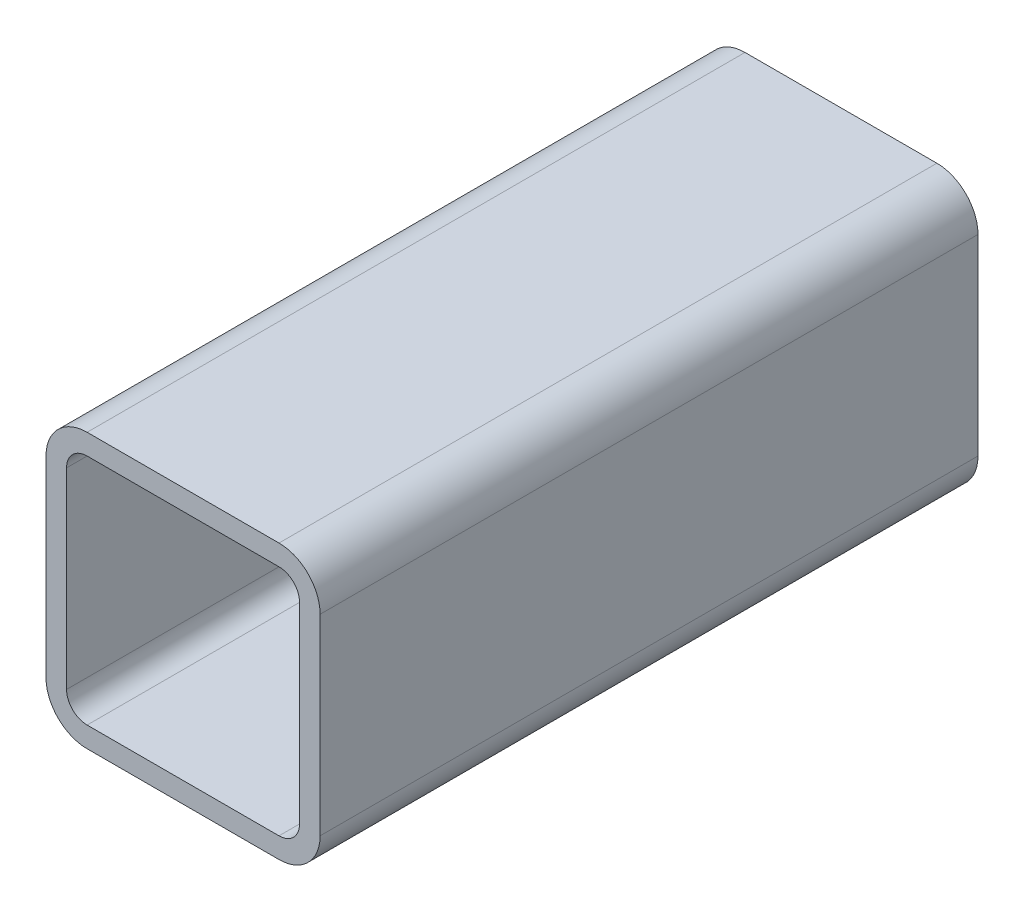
ISO-10303-21;
HEADER;
FILE_DESCRIPTION(('STEP AP214'),'2;1');
FILE_NAME('part.step','',(''),(''),'','','');
FILE_SCHEMA(('AUTOMOTIVE_DESIGN { 1 0 10303 214 1 1 1 1 }'));
ENDSEC;
DATA;
#1=APPLICATION_CONTEXT('core data for automotive mechanical design processes');
#2=APPLICATION_PROTOCOL_DEFINITION('international standard','automotive_design',2000,#1);
#3=PRODUCT_CONTEXT('',#1,'mechanical');
#4=PRODUCT('Part','Part','',(#3));
#5=PRODUCT_RELATED_PRODUCT_CATEGORY('part','',(#4));
#6=PRODUCT_DEFINITION_FORMATION('','',#4);
#7=PRODUCT_DEFINITION_CONTEXT('part definition',#1,'design');
#8=PRODUCT_DEFINITION('design','',#6,#7);
#9=PRODUCT_DEFINITION_SHAPE('','',#8);
#10=(LENGTH_UNIT() NAMED_UNIT(*) SI_UNIT(.MILLI.,.METRE.));
#11=(NAMED_UNIT(*) PLANE_ANGLE_UNIT() SI_UNIT($,.RADIAN.));
#12=(NAMED_UNIT(*) SI_UNIT($,.STERADIAN.) SOLID_ANGLE_UNIT());
#13=UNCERTAINTY_MEASURE_WITH_UNIT(LENGTH_MEASURE(1.E-05),#10,'distance_accuracy_value','');
#14=(GEOMETRIC_REPRESENTATION_CONTEXT(3) GLOBAL_UNCERTAINTY_ASSIGNED_CONTEXT((#13)) GLOBAL_UNIT_ASSIGNED_CONTEXT((#10,
#11,#12)) REPRESENTATION_CONTEXT('',''));
#15=CARTESIAN_POINT('',(0.,0.,0.));
#16=DIRECTION('',(0.,0.,1.));
#17=DIRECTION('',(1.,0.,0.));
#18=AXIS2_PLACEMENT_3D('',#15,#16,#17);
#19=CARTESIAN_POINT('',(19.9112396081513,109.98485662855,304.8));
#20=DIRECTION('',(0.,0.,1.));
#21=DIRECTION('',(1.,0.,0.));
#22=AXIS2_PLACEMENT_3D('',#19,#20,#21);
#23=PLANE('',#22);
#24=CARTESIAN_POINT('',(19.9112396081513,109.98485662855,304.8));
#25=DIRECTION('',(0.,0.,1.));
#26=DIRECTION('',(1.,0.,0.));
#27=AXIS2_PLACEMENT_3D('',#24,#25,#26);
#28=CIRCLE('',#27,19.05);
#29=CARTESIAN_POINT('',(19.9112396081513,129.03485662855,304.8));
#30=VERTEX_POINT('',#29);
#31=CARTESIAN_POINT('',(0.8612396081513,109.98485662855,304.8));
#32=VERTEX_POINT('',#31);
#33=EDGE_CURVE('E211',#30,#32,#28,.T.);
#34=ORIENTED_EDGE('',*,*,#33,.T.);
#35=DIRECTION('',(0.,-1.,0.));
#36=VECTOR('',#35,1.);
#37=CARTESIAN_POINT('',(0.8612396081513,21.0848566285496,304.8));
#38=LINE('',#37,#36);
#39=CARTESIAN_POINT('',(0.8612396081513,21.0848566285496,304.8));
#40=VERTEX_POINT('',#39);
#41=EDGE_CURVE('E214',#32,#40,#38,.T.);
#42=ORIENTED_EDGE('',*,*,#41,.T.);
#43=CARTESIAN_POINT('',(19.9112396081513,21.0848566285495,304.8));
#44=DIRECTION('',(0.,0.,1.));
#45=DIRECTION('',(1.,0.,0.));
#46=AXIS2_PLACEMENT_3D('',#43,#44,#45);
#47=CIRCLE('',#46,19.05);
#48=CARTESIAN_POINT('',(19.9112396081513,2.03485662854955,304.8));
#49=VERTEX_POINT('',#48);
#50=EDGE_CURVE('E217',#40,#49,#47,.T.);
#51=ORIENTED_EDGE('',*,*,#50,.T.);
#52=DIRECTION('',(1.,0.,0.));
#53=VECTOR('',#52,1.);
#54=CARTESIAN_POINT('',(108.811239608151,2.03485662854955,304.8));
#55=LINE('',#54,#53);
#56=CARTESIAN_POINT('',(108.811239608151,2.03485662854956,304.8));
#57=VERTEX_POINT('',#56);
#58=EDGE_CURVE('E219',#49,#57,#55,.T.);
#59=ORIENTED_EDGE('',*,*,#58,.T.);
#60=CARTESIAN_POINT('',(108.811239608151,21.0848566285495,304.8));
#61=DIRECTION('',(0.,0.,1.));
#62=DIRECTION('',(1.,0.,0.));
#63=AXIS2_PLACEMENT_3D('',#60,#61,#62);
#64=CIRCLE('',#63,19.05);
#65=CARTESIAN_POINT('',(127.861239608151,21.0848566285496,304.8));
#66=VERTEX_POINT('',#65);
#67=EDGE_CURVE('E221',#57,#66,#64,.T.);
#68=ORIENTED_EDGE('',*,*,#67,.T.);
#69=DIRECTION('',(0.,1.,0.));
#70=VECTOR('',#69,1.);
#71=CARTESIAN_POINT('',(127.861239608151,109.98485662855,304.8));
#72=LINE('',#71,#70);
#73=CARTESIAN_POINT('',(127.861239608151,109.98485662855,304.8));
#74=VERTEX_POINT('',#73);
#75=EDGE_CURVE('E223',#66,#74,#72,.T.);
#76=ORIENTED_EDGE('',*,*,#75,.T.);
#77=CARTESIAN_POINT('',(108.811239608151,109.98485662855,304.8));
#78=DIRECTION('',(0.,0.,1.));
#79=DIRECTION('',(1.,0.,0.));
#80=AXIS2_PLACEMENT_3D('',#77,#78,#79);
#81=CIRCLE('',#80,19.05);
#82=CARTESIAN_POINT('',(108.811239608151,129.03485662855,304.8));
#83=VERTEX_POINT('',#82);
#84=EDGE_CURVE('E225',#74,#83,#81,.T.);
#85=ORIENTED_EDGE('',*,*,#84,.T.);
#86=DIRECTION('',(-1.,0.,0.));
#87=VECTOR('',#86,1.);
#88=CARTESIAN_POINT('',(19.9112396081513,129.03485662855,304.8));
#89=LINE('',#88,#87);
#90=EDGE_CURVE('E227',#83,#30,#89,.T.);
#91=ORIENTED_EDGE('',*,*,#90,.T.);
#92=EDGE_LOOP('',(#34,#42,#51,#59,#68,#76,#85,#91));
#93=FACE_BOUND('',#92,.T.);
#94=DIRECTION('',(0.,-1.,0.));
#95=VECTOR('',#94,1.);
#96=CARTESIAN_POINT('',(10.3862396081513,21.0848566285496,304.8));
#97=LINE('',#96,#95);
#98=CARTESIAN_POINT('',(10.3862396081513,109.98485662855,304.8));
#99=VERTEX_POINT('',#98);
#100=CARTESIAN_POINT('',(10.3862396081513,21.0848566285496,304.8));
#101=VERTEX_POINT('',#100);
#102=EDGE_CURVE('E154',#99,#101,#97,.T.);
#103=ORIENTED_EDGE('',*,*,#102,.F.);
#104=CARTESIAN_POINT('',(19.9112396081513,109.98485662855,304.8));
#105=DIRECTION('',(0.,0.,1.));
#106=DIRECTION('',(1.,0.,0.));
#107=AXIS2_PLACEMENT_3D('',#104,#105,#106);
#108=CIRCLE('',#107,9.52499999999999);
#109=CARTESIAN_POINT('',(19.9112396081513,119.50985662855,304.8));
#110=VERTEX_POINT('',#109);
#111=EDGE_CURVE('E146',#110,#99,#108,.T.);
#112=ORIENTED_EDGE('',*,*,#111,.F.);
#113=DIRECTION('',(-1.,0.,0.));
#114=VECTOR('',#113,1.);
#115=CARTESIAN_POINT('',(19.9112396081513,119.50985662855,304.8));
#116=LINE('',#115,#114);
#117=CARTESIAN_POINT('',(108.811239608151,119.50985662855,304.8));
#118=VERTEX_POINT('',#117);
#119=EDGE_CURVE('E179',#118,#110,#116,.T.);
#120=ORIENTED_EDGE('',*,*,#119,.F.);
#121=CARTESIAN_POINT('',(108.811239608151,109.98485662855,304.8));
#122=DIRECTION('',(0.,0.,1.));
#123=DIRECTION('',(1.,0.,0.));
#124=AXIS2_PLACEMENT_3D('',#121,#122,#123);
#125=CIRCLE('',#124,9.52500000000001);
#126=CARTESIAN_POINT('',(118.336239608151,109.98485662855,304.8));
#127=VERTEX_POINT('',#126);
#128=EDGE_CURVE('E177',#127,#118,#125,.T.);
#129=ORIENTED_EDGE('',*,*,#128,.F.);
#130=DIRECTION('',(0.,1.,0.));
#131=VECTOR('',#130,1.);
#132=CARTESIAN_POINT('',(118.336239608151,109.98485662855,304.8));
#133=LINE('',#132,#131);
#134=CARTESIAN_POINT('',(118.336239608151,21.0848566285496,304.8));
#135=VERTEX_POINT('',#134);
#136=EDGE_CURVE('E175',#135,#127,#133,.T.);
#137=ORIENTED_EDGE('',*,*,#136,.F.);
#138=CARTESIAN_POINT('',(108.811239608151,21.0848566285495,304.8));
#139=DIRECTION('',(0.,0.,1.));
#140=DIRECTION('',(1.,0.,0.));
#141=AXIS2_PLACEMENT_3D('',#138,#139,#140);
#142=CIRCLE('',#141,9.52499999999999);
#143=CARTESIAN_POINT('',(108.811239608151,11.5598566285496,304.8));
#144=VERTEX_POINT('',#143);
#145=EDGE_CURVE('E173',#144,#135,#142,.T.);
#146=ORIENTED_EDGE('',*,*,#145,.F.);
#147=DIRECTION('',(1.,0.,0.));
#148=VECTOR('',#147,1.);
#149=CARTESIAN_POINT('',(108.811239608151,11.5598566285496,304.8));
#150=LINE('',#149,#148);
#151=CARTESIAN_POINT('',(19.9112396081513,11.5598566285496,304.8));
#152=VERTEX_POINT('',#151);
#153=EDGE_CURVE('E169',#152,#144,#150,.T.);
#154=ORIENTED_EDGE('',*,*,#153,.F.);
#155=CARTESIAN_POINT('',(19.9112396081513,21.0848566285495,304.8));
#156=DIRECTION('',(0.,0.,1.));
#157=DIRECTION('',(1.,0.,0.));
#158=AXIS2_PLACEMENT_3D('',#155,#156,#157);
#159=CIRCLE('',#158,9.52499999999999);
#160=EDGE_CURVE('E167',#101,#152,#159,.T.);
#161=ORIENTED_EDGE('',*,*,#160,.F.);
#162=EDGE_LOOP('',(#103,#112,#120,#129,#137,#146,#154,#161));
#163=FACE_BOUND('',#162,.T.);
#164=ADVANCED_FACE('F33',(#93,#163),#23,.T.);
#165=CARTESIAN_POINT('',(19.9112396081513,109.98485662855,0.));
#166=DIRECTION('',(0.,0.,1.));
#167=DIRECTION('',(1.,0.,0.));
#168=AXIS2_PLACEMENT_3D('',#165,#166,#167);
#169=PLANE('',#168);
#170=CARTESIAN_POINT('',(19.9112396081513,109.98485662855,0.));
#171=DIRECTION('',(0.,0.,1.));
#172=DIRECTION('',(1.,0.,0.));
#173=AXIS2_PLACEMENT_3D('',#170,#171,#172);
#174=CIRCLE('',#173,19.05);
#175=CARTESIAN_POINT('',(19.9112396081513,129.03485662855,0.));
#176=VERTEX_POINT('',#175);
#177=CARTESIAN_POINT('',(0.8612396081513,109.98485662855,0.));
#178=VERTEX_POINT('',#177);
#179=EDGE_CURVE('E162',#176,#178,#174,.T.);
#180=ORIENTED_EDGE('',*,*,#179,.F.);
#181=DIRECTION('',(-1.,0.,0.));
#182=VECTOR('',#181,1.);
#183=CARTESIAN_POINT('',(19.9112396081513,129.03485662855,0.));
#184=LINE('',#183,#182);
#185=CARTESIAN_POINT('',(108.811239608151,129.03485662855,0.));
#186=VERTEX_POINT('',#185);
#187=EDGE_CURVE('E215',#186,#176,#184,.T.);
#188=ORIENTED_EDGE('',*,*,#187,.F.);
#189=CARTESIAN_POINT('',(108.811239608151,109.98485662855,0.));
#190=DIRECTION('',(0.,0.,1.));
#191=DIRECTION('',(1.,0.,0.));
#192=AXIS2_PLACEMENT_3D('',#189,#190,#191);
#193=CIRCLE('',#192,19.05);
#194=CARTESIAN_POINT('',(127.861239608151,109.98485662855,0.));
#195=VERTEX_POINT('',#194);
#196=EDGE_CURVE('E242',#195,#186,#193,.T.);
#197=ORIENTED_EDGE('',*,*,#196,.F.);
#198=DIRECTION('',(0.,1.,0.));
#199=VECTOR('',#198,1.);
#200=CARTESIAN_POINT('',(127.861239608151,109.98485662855,0.));
#201=LINE('',#200,#199);
#202=CARTESIAN_POINT('',(127.861239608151,21.0848566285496,0.));
#203=VERTEX_POINT('',#202);
#204=EDGE_CURVE('E240',#203,#195,#201,.T.);
#205=ORIENTED_EDGE('',*,*,#204,.F.);
#206=CARTESIAN_POINT('',(108.811239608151,21.0848566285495,0.));
#207=DIRECTION('',(0.,0.,1.));
#208=DIRECTION('',(1.,0.,0.));
#209=AXIS2_PLACEMENT_3D('',#206,#207,#208);
#210=CIRCLE('',#209,19.05);
#211=CARTESIAN_POINT('',(108.811239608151,2.03485662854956,0.));
#212=VERTEX_POINT('',#211);
#213=EDGE_CURVE('E238',#212,#203,#210,.T.);
#214=ORIENTED_EDGE('',*,*,#213,.F.);
#215=DIRECTION('',(1.,0.,0.));
#216=VECTOR('',#215,1.);
#217=CARTESIAN_POINT('',(108.811239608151,2.03485662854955,0.));
#218=LINE('',#217,#216);
#219=CARTESIAN_POINT('',(19.9112396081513,2.03485662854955,0.));
#220=VERTEX_POINT('',#219);
#221=EDGE_CURVE('E236',#220,#212,#218,.T.);
#222=ORIENTED_EDGE('',*,*,#221,.F.);
#223=CARTESIAN_POINT('',(19.9112396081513,21.0848566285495,0.));
#224=DIRECTION('',(0.,0.,1.));
#225=DIRECTION('',(1.,0.,0.));
#226=AXIS2_PLACEMENT_3D('',#223,#224,#225);
#227=CIRCLE('',#226,19.05);
#228=CARTESIAN_POINT('',(0.8612396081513,21.0848566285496,0.));
#229=VERTEX_POINT('',#228);
#230=EDGE_CURVE('E234',#229,#220,#227,.T.);
#231=ORIENTED_EDGE('',*,*,#230,.F.);
#232=DIRECTION('',(0.,-1.,0.));
#233=VECTOR('',#232,1.);
#234=CARTESIAN_POINT('',(0.8612396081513,21.0848566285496,0.));
#235=LINE('',#234,#233);
#236=EDGE_CURVE('E232',#178,#229,#235,.T.);
#237=ORIENTED_EDGE('',*,*,#236,.F.);
#238=EDGE_LOOP('',(#180,#188,#197,#205,#214,#222,#231,#237));
#239=FACE_BOUND('',#238,.T.);
#240=CARTESIAN_POINT('',(19.9112396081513,109.98485662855,0.));
#241=DIRECTION('',(0.,0.,1.));
#242=DIRECTION('',(1.,0.,0.));
#243=AXIS2_PLACEMENT_3D('',#240,#241,#242);
#244=CIRCLE('',#243,9.52499999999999);
#245=CARTESIAN_POINT('',(19.9112396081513,119.50985662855,0.));
#246=VERTEX_POINT('',#245);
#247=CARTESIAN_POINT('',(10.3862396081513,109.98485662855,0.));
#248=VERTEX_POINT('',#247);
#249=EDGE_CURVE('E56',#246,#248,#244,.T.);
#250=ORIENTED_EDGE('',*,*,#249,.T.);
#251=DIRECTION('',(0.,-1.,0.));
#252=VECTOR('',#251,1.);
#253=CARTESIAN_POINT('',(10.3862396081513,21.0848566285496,0.));
#254=LINE('',#253,#252);
#255=CARTESIAN_POINT('',(10.3862396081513,21.0848566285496,0.));
#256=VERTEX_POINT('',#255);
#257=EDGE_CURVE('E161',#248,#256,#254,.T.);
#258=ORIENTED_EDGE('',*,*,#257,.T.);
#259=CARTESIAN_POINT('',(19.9112396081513,21.0848566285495,0.));
#260=DIRECTION('',(0.,0.,1.));
#261=DIRECTION('',(1.,0.,0.));
#262=AXIS2_PLACEMENT_3D('',#259,#260,#261);
#263=CIRCLE('',#262,9.52499999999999);
#264=CARTESIAN_POINT('',(19.9112396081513,11.5598566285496,0.));
#265=VERTEX_POINT('',#264);
#266=EDGE_CURVE('E183',#256,#265,#263,.T.);
#267=ORIENTED_EDGE('',*,*,#266,.T.);
#268=DIRECTION('',(1.,0.,0.));
#269=VECTOR('',#268,1.);
#270=CARTESIAN_POINT('',(108.811239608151,11.5598566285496,0.));
#271=LINE('',#270,#269);
#272=CARTESIAN_POINT('',(108.811239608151,11.5598566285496,0.));
#273=VERTEX_POINT('',#272);
#274=EDGE_CURVE('E186',#265,#273,#271,.T.);
#275=ORIENTED_EDGE('',*,*,#274,.T.);
#276=CARTESIAN_POINT('',(108.811239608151,21.0848566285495,0.));
#277=DIRECTION('',(0.,0.,1.));
#278=DIRECTION('',(1.,0.,0.));
#279=AXIS2_PLACEMENT_3D('',#276,#277,#278);
#280=CIRCLE('',#279,9.52499999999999);
#281=CARTESIAN_POINT('',(118.336239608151,21.0848566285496,0.));
#282=VERTEX_POINT('',#281);
#283=EDGE_CURVE('E189',#273,#282,#280,.T.);
#284=ORIENTED_EDGE('',*,*,#283,.T.);
#285=DIRECTION('',(0.,1.,0.));
#286=VECTOR('',#285,1.);
#287=CARTESIAN_POINT('',(118.336239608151,109.98485662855,0.));
#288=LINE('',#287,#286);
#289=CARTESIAN_POINT('',(118.336239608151,109.98485662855,0.));
#290=VERTEX_POINT('',#289);
#291=EDGE_CURVE('E192',#282,#290,#288,.T.);
#292=ORIENTED_EDGE('',*,*,#291,.T.);
#293=CARTESIAN_POINT('',(108.811239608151,109.98485662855,0.));
#294=DIRECTION('',(0.,0.,1.));
#295=DIRECTION('',(1.,0.,0.));
#296=AXIS2_PLACEMENT_3D('',#293,#294,#295);
#297=CIRCLE('',#296,9.52500000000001);
#298=CARTESIAN_POINT('',(108.811239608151,119.50985662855,0.));
#299=VERTEX_POINT('',#298);
#300=EDGE_CURVE('E195',#290,#299,#297,.T.);
#301=ORIENTED_EDGE('',*,*,#300,.T.);
#302=DIRECTION('',(-1.,0.,0.));
#303=VECTOR('',#302,1.);
#304=CARTESIAN_POINT('',(19.9112396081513,119.50985662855,0.));
#305=LINE('',#304,#303);
#306=EDGE_CURVE('E155',#299,#246,#305,.T.);
#307=ORIENTED_EDGE('',*,*,#306,.T.);
#308=EDGE_LOOP('',(#250,#258,#267,#275,#284,#292,#301,#307));
#309=FACE_BOUND('',#308,.T.);
#310=ADVANCED_FACE('F272',(#239,#309),#169,.F.);
#311=CARTESIAN_POINT('',(19.9112396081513,109.98485662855,304.8));
#312=DIRECTION('',(0.,0.,-1.));
#313=DIRECTION('',(-1.,0.,0.));
#314=AXIS2_PLACEMENT_3D('',#311,#312,#313);
#315=CYLINDRICAL_SURFACE('',#314,19.05);
#316=ORIENTED_EDGE('',*,*,#179,.T.);
#317=DIRECTION('',(0.,0.,-1.));
#318=VECTOR('',#317,1.);
#319=CARTESIAN_POINT('',(0.8612396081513,109.98485662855,304.8));
#320=LINE('',#319,#318);
#321=EDGE_CURVE('E11',#32,#178,#320,.T.);
#322=ORIENTED_EDGE('',*,*,#321,.F.);
#323=ORIENTED_EDGE('',*,*,#33,.F.);
#324=DIRECTION('',(0.,0.,-1.));
#325=VECTOR('',#324,1.);
#326=CARTESIAN_POINT('',(19.9112396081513,129.03485662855,304.8));
#327=LINE('',#326,#325);
#328=EDGE_CURVE('E229',#30,#176,#327,.T.);
#329=ORIENTED_EDGE('',*,*,#328,.T.);
#330=EDGE_LOOP('',(#316,#322,#323,#329));
#331=FACE_BOUND('',#330,.T.);
#332=ADVANCED_FACE('F35',(#331),#315,.T.);
#333=CARTESIAN_POINT('',(0.8612396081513,21.0848566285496,304.8));
#334=DIRECTION('',(1.,0.,0.));
#335=DIRECTION('',(0.,0.,-1.));
#336=AXIS2_PLACEMENT_3D('',#333,#334,#335);
#337=PLANE('',#336);
#338=ORIENTED_EDGE('',*,*,#236,.T.);
#339=DIRECTION('',(0.,0.,-1.));
#340=VECTOR('',#339,1.);
#341=CARTESIAN_POINT('',(0.8612396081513,21.0848566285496,304.8));
#342=LINE('',#341,#340);
#343=EDGE_CURVE('E41',#40,#229,#342,.T.);
#344=ORIENTED_EDGE('',*,*,#343,.F.);
#345=ORIENTED_EDGE('',*,*,#41,.F.);
#346=ORIENTED_EDGE('',*,*,#321,.T.);
#347=EDGE_LOOP('',(#338,#344,#345,#346));
#348=FACE_BOUND('',#347,.T.);
#349=ADVANCED_FACE('F289',(#348),#337,.F.);
#350=CARTESIAN_POINT('',(19.9112396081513,21.0848566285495,304.8));
#351=DIRECTION('',(0.,0.,-1.));
#352=DIRECTION('',(-1.,0.,0.));
#353=AXIS2_PLACEMENT_3D('',#350,#351,#352);
#354=CYLINDRICAL_SURFACE('',#353,19.05);
#355=ORIENTED_EDGE('',*,*,#230,.T.);
#356=DIRECTION('',(0.,0.,-1.));
#357=VECTOR('',#356,1.);
#358=CARTESIAN_POINT('',(19.9112396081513,2.03485662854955,304.8));
#359=LINE('',#358,#357);
#360=EDGE_CURVE('E259',#49,#220,#359,.T.);
#361=ORIENTED_EDGE('',*,*,#360,.F.);
#362=ORIENTED_EDGE('',*,*,#50,.F.);
#363=ORIENTED_EDGE('',*,*,#343,.T.);
#364=EDGE_LOOP('',(#355,#361,#362,#363));
#365=FACE_BOUND('',#364,.T.);
#366=ADVANCED_FACE('F266',(#365),#354,.T.);
#367=CARTESIAN_POINT('',(108.811239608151,2.03485662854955,304.8));
#368=DIRECTION('',(0.,1.,0.));
#369=DIRECTION('',(0.,0.,1.));
#370=AXIS2_PLACEMENT_3D('',#367,#368,#369);
#371=PLANE('',#370);
#372=ORIENTED_EDGE('',*,*,#221,.T.);
#373=DIRECTION('',(0.,0.,-1.));
#374=VECTOR('',#373,1.);
#375=CARTESIAN_POINT('',(108.811239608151,2.03485662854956,304.8));
#376=LINE('',#375,#374);
#377=EDGE_CURVE('E256',#57,#212,#376,.T.);
#378=ORIENTED_EDGE('',*,*,#377,.F.);
#379=ORIENTED_EDGE('',*,*,#58,.F.);
#380=ORIENTED_EDGE('',*,*,#360,.T.);
#381=EDGE_LOOP('',(#372,#378,#379,#380));
#382=FACE_BOUND('',#381,.T.);
#383=ADVANCED_FACE('F278',(#382),#371,.F.);
#384=CARTESIAN_POINT('',(108.811239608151,21.0848566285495,304.8));
#385=DIRECTION('',(0.,0.,-1.));
#386=DIRECTION('',(-1.,0.,0.));
#387=AXIS2_PLACEMENT_3D('',#384,#385,#386);
#388=CYLINDRICAL_SURFACE('',#387,19.05);
#389=ORIENTED_EDGE('',*,*,#213,.T.);
#390=DIRECTION('',(0.,0.,-1.));
#391=VECTOR('',#390,1.);
#392=CARTESIAN_POINT('',(127.861239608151,21.0848566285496,304.8));
#393=LINE('',#392,#391);
#394=EDGE_CURVE('E253',#66,#203,#393,.T.);
#395=ORIENTED_EDGE('',*,*,#394,.F.);
#396=ORIENTED_EDGE('',*,*,#67,.F.);
#397=ORIENTED_EDGE('',*,*,#377,.T.);
#398=EDGE_LOOP('',(#389,#395,#396,#397));
#399=FACE_BOUND('',#398,.T.);
#400=ADVANCED_FACE('F282',(#399),#388,.T.);
#401=CARTESIAN_POINT('',(127.861239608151,109.98485662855,304.8));
#402=DIRECTION('',(-1.,0.,0.));
#403=DIRECTION('',(0.,0.,1.));
#404=AXIS2_PLACEMENT_3D('',#401,#402,#403);
#405=PLANE('',#404);
#406=ORIENTED_EDGE('',*,*,#204,.T.);
#407=DIRECTION('',(0.,0.,-1.));
#408=VECTOR('',#407,1.);
#409=CARTESIAN_POINT('',(127.861239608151,109.98485662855,304.8));
#410=LINE('',#409,#408);
#411=EDGE_CURVE('E250',#74,#195,#410,.T.);
#412=ORIENTED_EDGE('',*,*,#411,.F.);
#413=ORIENTED_EDGE('',*,*,#75,.F.);
#414=ORIENTED_EDGE('',*,*,#394,.T.);
#415=EDGE_LOOP('',(#406,#412,#413,#414));
#416=FACE_BOUND('',#415,.T.);
#417=ADVANCED_FACE('F302',(#416),#405,.F.);
#418=CARTESIAN_POINT('',(108.811239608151,109.98485662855,304.8));
#419=DIRECTION('',(0.,0.,-1.));
#420=DIRECTION('',(-1.,0.,0.));
#421=AXIS2_PLACEMENT_3D('',#418,#419,#420);
#422=CYLINDRICAL_SURFACE('',#421,19.05);
#423=ORIENTED_EDGE('',*,*,#196,.T.);
#424=DIRECTION('',(0.,0.,-1.));
#425=VECTOR('',#424,1.);
#426=CARTESIAN_POINT('',(108.811239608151,129.03485662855,304.8));
#427=LINE('',#426,#425);
#428=EDGE_CURVE('E247',#83,#186,#427,.T.);
#429=ORIENTED_EDGE('',*,*,#428,.F.);
#430=ORIENTED_EDGE('',*,*,#84,.F.);
#431=ORIENTED_EDGE('',*,*,#411,.T.);
#432=EDGE_LOOP('',(#423,#429,#430,#431));
#433=FACE_BOUND('',#432,.T.);
#434=ADVANCED_FACE('F300',(#433),#422,.T.);
#435=CARTESIAN_POINT('',(19.9112396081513,129.03485662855,304.8));
#436=DIRECTION('',(0.,-1.,0.));
#437=DIRECTION('',(0.,0.,-1.));
#438=AXIS2_PLACEMENT_3D('',#435,#436,#437);
#439=PLANE('',#438);
#440=ORIENTED_EDGE('',*,*,#187,.T.);
#441=ORIENTED_EDGE('',*,*,#328,.F.);
#442=ORIENTED_EDGE('',*,*,#90,.F.);
#443=ORIENTED_EDGE('',*,*,#428,.T.);
#444=EDGE_LOOP('',(#440,#441,#442,#443));
#445=FACE_BOUND('',#444,.T.);
#446=ADVANCED_FACE('F295',(#445),#439,.F.);
#447=CARTESIAN_POINT('',(19.9112396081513,109.98485662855,304.8));
#448=DIRECTION('',(0.,0.,-1.));
#449=DIRECTION('',(-1.,0.,0.));
#450=AXIS2_PLACEMENT_3D('',#447,#448,#449);
#451=CYLINDRICAL_SURFACE('',#450,9.52499999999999);
#452=ORIENTED_EDGE('',*,*,#249,.F.);
#453=DIRECTION('',(0.,0.,-1.));
#454=VECTOR('',#453,1.);
#455=CARTESIAN_POINT('',(19.9112396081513,119.50985662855,304.8));
#456=LINE('',#455,#454);
#457=EDGE_CURVE('E150',#110,#246,#456,.T.);
#458=ORIENTED_EDGE('',*,*,#457,.F.);
#459=ORIENTED_EDGE('',*,*,#111,.T.);
#460=DIRECTION('',(0.,0.,-1.));
#461=VECTOR('',#460,1.);
#462=CARTESIAN_POINT('',(10.3862396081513,109.98485662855,304.8));
#463=LINE('',#462,#461);
#464=EDGE_CURVE('E149',#99,#248,#463,.T.);
#465=ORIENTED_EDGE('',*,*,#464,.T.);
#466=EDGE_LOOP('',(#452,#458,#459,#465));
#467=FACE_BOUND('',#466,.T.);
#468=ADVANCED_FACE('F148',(#467),#451,.F.);
#469=CARTESIAN_POINT('',(10.3862396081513,21.0848566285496,304.8));
#470=DIRECTION('',(1.,0.,0.));
#471=DIRECTION('',(0.,0.,-1.));
#472=AXIS2_PLACEMENT_3D('',#469,#470,#471);
#473=PLANE('',#472);
#474=ORIENTED_EDGE('',*,*,#257,.F.);
#475=ORIENTED_EDGE('',*,*,#464,.F.);
#476=ORIENTED_EDGE('',*,*,#102,.T.);
#477=DIRECTION('',(0.,0.,-1.));
#478=VECTOR('',#477,1.);
#479=CARTESIAN_POINT('',(10.3862396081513,21.0848566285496,304.8));
#480=LINE('',#479,#478);
#481=EDGE_CURVE('E163',#101,#256,#480,.T.);
#482=ORIENTED_EDGE('',*,*,#481,.T.);
#483=EDGE_LOOP('',(#474,#475,#476,#482));
#484=FACE_BOUND('',#483,.T.);
#485=ADVANCED_FACE('F158',(#484),#473,.T.);
#486=CARTESIAN_POINT('',(19.9112396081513,21.0848566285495,304.8));
#487=DIRECTION('',(0.,0.,-1.));
#488=DIRECTION('',(-1.,0.,0.));
#489=AXIS2_PLACEMENT_3D('',#486,#487,#488);
#490=CYLINDRICAL_SURFACE('',#489,9.52499999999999);
#491=ORIENTED_EDGE('',*,*,#266,.F.);
#492=ORIENTED_EDGE('',*,*,#481,.F.);
#493=ORIENTED_EDGE('',*,*,#160,.T.);
#494=DIRECTION('',(0.,0.,-1.));
#495=VECTOR('',#494,1.);
#496=CARTESIAN_POINT('',(19.9112396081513,11.5598566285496,304.8));
#497=LINE('',#496,#495);
#498=EDGE_CURVE('E208',#152,#265,#497,.T.);
#499=ORIENTED_EDGE('',*,*,#498,.T.);
#500=EDGE_LOOP('',(#491,#492,#493,#499));
#501=FACE_BOUND('',#500,.T.);
#502=ADVANCED_FACE('F327',(#501),#490,.F.);
#503=CARTESIAN_POINT('',(108.811239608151,11.5598566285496,304.8));
#504=DIRECTION('',(0.,1.,0.));
#505=DIRECTION('',(0.,0.,1.));
#506=AXIS2_PLACEMENT_3D('',#503,#504,#505);
#507=PLANE('',#506);
#508=ORIENTED_EDGE('',*,*,#274,.F.);
#509=ORIENTED_EDGE('',*,*,#498,.F.);
#510=ORIENTED_EDGE('',*,*,#153,.T.);
#511=DIRECTION('',(0.,0.,-1.));
#512=VECTOR('',#511,1.);
#513=CARTESIAN_POINT('',(108.811239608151,11.5598566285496,304.8));
#514=LINE('',#513,#512);
#515=EDGE_CURVE('E206',#144,#273,#514,.T.);
#516=ORIENTED_EDGE('',*,*,#515,.T.);
#517=EDGE_LOOP('',(#508,#509,#510,#516));
#518=FACE_BOUND('',#517,.T.);
#519=ADVANCED_FACE('F331',(#518),#507,.T.);
#520=CARTESIAN_POINT('',(108.811239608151,21.0848566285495,304.8));
#521=DIRECTION('',(0.,0.,-1.));
#522=DIRECTION('',(-1.,0.,0.));
#523=AXIS2_PLACEMENT_3D('',#520,#521,#522);
#524=CYLINDRICAL_SURFACE('',#523,9.52499999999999);
#525=ORIENTED_EDGE('',*,*,#283,.F.);
#526=ORIENTED_EDGE('',*,*,#515,.F.);
#527=ORIENTED_EDGE('',*,*,#145,.T.);
#528=DIRECTION('',(0.,0.,-1.));
#529=VECTOR('',#528,1.);
#530=CARTESIAN_POINT('',(118.336239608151,21.0848566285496,304.8));
#531=LINE('',#530,#529);
#532=EDGE_CURVE('E204',#135,#282,#531,.T.);
#533=ORIENTED_EDGE('',*,*,#532,.T.);
#534=EDGE_LOOP('',(#525,#526,#527,#533));
#535=FACE_BOUND('',#534,.T.);
#536=ADVANCED_FACE('F337',(#535),#524,.F.);
#537=CARTESIAN_POINT('',(118.336239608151,109.98485662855,304.8));
#538=DIRECTION('',(-1.,0.,0.));
#539=DIRECTION('',(0.,0.,1.));
#540=AXIS2_PLACEMENT_3D('',#537,#538,#539);
#541=PLANE('',#540);
#542=ORIENTED_EDGE('',*,*,#291,.F.);
#543=ORIENTED_EDGE('',*,*,#532,.F.);
#544=ORIENTED_EDGE('',*,*,#136,.T.);
#545=DIRECTION('',(0.,0.,-1.));
#546=VECTOR('',#545,1.);
#547=CARTESIAN_POINT('',(118.336239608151,109.98485662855,304.8));
#548=LINE('',#547,#546);
#549=EDGE_CURVE('E202',#127,#290,#548,.T.);
#550=ORIENTED_EDGE('',*,*,#549,.T.);
#551=EDGE_LOOP('',(#542,#543,#544,#550));
#552=FACE_BOUND('',#551,.T.);
#553=ADVANCED_FACE('F341',(#552),#541,.T.);
#554=CARTESIAN_POINT('',(108.811239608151,109.98485662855,304.8));
#555=DIRECTION('',(0.,0.,-1.));
#556=DIRECTION('',(-1.,0.,0.));
#557=AXIS2_PLACEMENT_3D('',#554,#555,#556);
#558=CYLINDRICAL_SURFACE('',#557,9.52500000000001);
#559=ORIENTED_EDGE('',*,*,#300,.F.);
#560=ORIENTED_EDGE('',*,*,#549,.F.);
#561=ORIENTED_EDGE('',*,*,#128,.T.);
#562=DIRECTION('',(0.,0.,-1.));
#563=VECTOR('',#562,1.);
#564=CARTESIAN_POINT('',(108.811239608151,119.50985662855,304.8));
#565=LINE('',#564,#563);
#566=EDGE_CURVE('E48',#118,#299,#565,.T.);
#567=ORIENTED_EDGE('',*,*,#566,.T.);
#568=EDGE_LOOP('',(#559,#560,#561,#567));
#569=FACE_BOUND('',#568,.T.);
#570=ADVANCED_FACE('F345',(#569),#558,.F.);
#571=CARTESIAN_POINT('',(19.9112396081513,119.50985662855,304.8));
#572=DIRECTION('',(0.,-1.,0.));
#573=DIRECTION('',(0.,0.,-1.));
#574=AXIS2_PLACEMENT_3D('',#571,#572,#573);
#575=PLANE('',#574);
#576=ORIENTED_EDGE('',*,*,#306,.F.);
#577=ORIENTED_EDGE('',*,*,#566,.F.);
#578=ORIENTED_EDGE('',*,*,#119,.T.);
#579=ORIENTED_EDGE('',*,*,#457,.T.);
#580=EDGE_LOOP('',(#576,#577,#578,#579));
#581=FACE_BOUND('',#580,.T.);
#582=ADVANCED_FACE('F349',(#581),#575,.T.);
#583=CLOSED_SHELL('',(#164,#310,#332,#349,#366,#383,#400,#417,#434,#446,#468,#485,#502,#519,
#536,#553,#570,#582));
#584=MANIFOLD_SOLID_BREP('B2',#583);
#585=ADVANCED_BREP_SHAPE_REPRESENTATION('',(#18,#584),#14);
#586=SHAPE_DEFINITION_REPRESENTATION(#9,#585);
ENDSEC;
END-ISO-10303-21;
